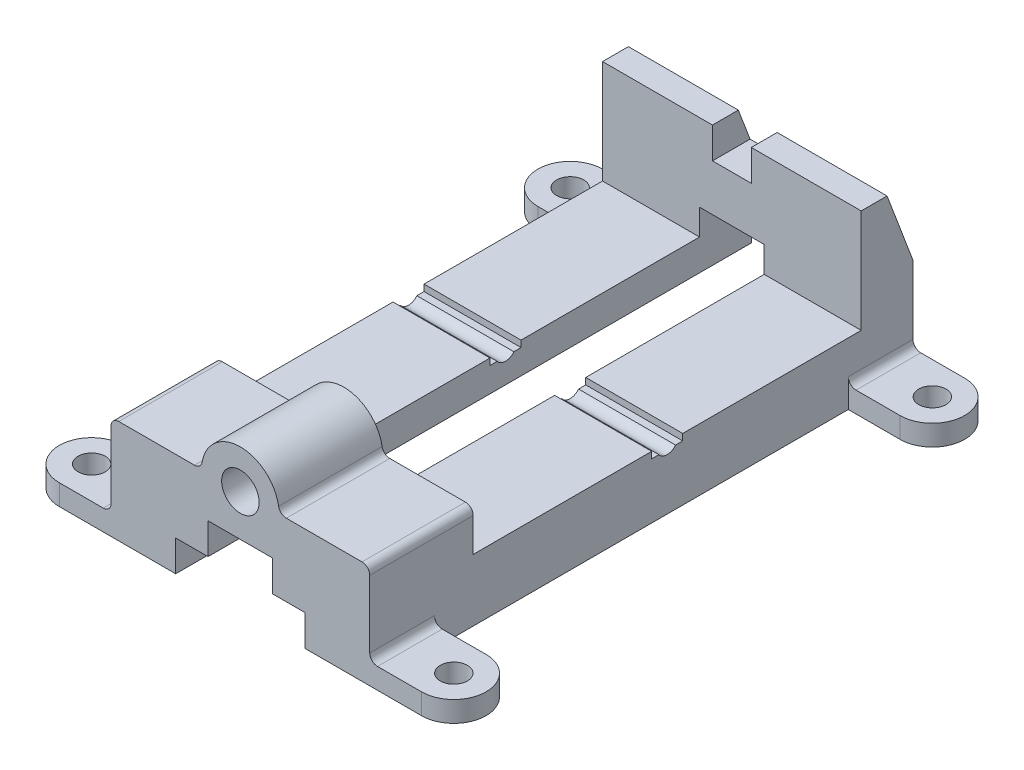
from build123d import *

# Parameters (mm, degrees)
EXTRUDE1_DEPTH             = 210
CUT_EXTRUDE1_REACH         = 241.008
SKETCH2_W                  = 150
SKETCH2_H                  = 31
SKETCH4_W                  = 100
SKETCH4_H                  = 40
EXTRUDE2_DEPTH             = 20
CUT_EXTRUDE2_REACH         = 208.63
SKETCH5_W                  = 25
SKETCH5_H                  = 10
M16X1_5_TAPPED_HOLE1_D     = 14.5
M16X1_5_TAPPED_HOLE1_DEPTH = 40
EXTRUDE3_DEPTH             = 8
M12X1_5_TAPPED_HOLE1_D     = 10.5
FILLET2_R                  = 3
CUT_EXTRUDE3_DEPTH         = 257.422015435
CUT_EXTRUDE4_DEPTH         = 257.422015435
SKETCH14_W                 = 15
SKETCH14_H                 = 20
CUT_EXTRUDE6_DEPTH         = 12


with BuildPart() as part:
    # Sketch1 → Extrude1 (new body)
    with BuildSketch(Plane.XY):
        with BuildLine():
            Line((-25, 0), (-50, 0))
            Line((-50, 0), (-50, 40))
            Line((-50, 40), (-15, 40))
            ThreePointArc((-15, 40), (0, 55), (15, 40))
            Line((15, 40), (50, 40))
            Line((50, 40), (50, 0))
            Line((50, 0), (25, 0))
            Line((25, 0), (25, 12))
            Line((25, 12), (12.5, 12))
            Line((12.5, 12), (12.5, 24))
            Line((12.5, 24), (-12.5, 24))
            Line((-12.5, 24), (-12.5, 12))
            Line((-12.5, 12), (-25, 12))
            Line((-25, 12), (-25, 0))
        make_face()
    extrude(amount=-EXTRUDE1_DEPTH)

    # Sketch2 → Cut-Extrude1 (cut, up to next)
    with BuildSketch(Plane(origin=(50, 0, 0), x_dir=(0, 0, -1), z_dir=(1, 0, 0)), mode=Mode.PRIVATE) as cut_extrude1_sk1:
        with Locations((115, 39.5)):
            Rectangle(SKETCH2_W, SKETCH2_H)
    cut_extrude1_tool1 = extrude(cut_extrude1_sk1.sketch, amount=-CUT_EXTRUDE1_REACH, mode=Mode.PRIVATE) & part.part
    add(cut_extrude1_tool1.solids().sort_by_distance((50, 39.5, -115))[0], mode=Mode.SUBTRACT)

    # Sketch4 → Extrude2 (add)
    with BuildSketch(Plane.XY.offset(-190)):
        with Locations((0, 44)):
            Rectangle(SKETCH4_W, SKETCH4_H)
    extrude(amount=-EXTRUDE2_DEPTH)

    # Sketch5 → Cut-Extrude2 (cut, up to next)
    with BuildSketch(Plane.XY.offset(-190), mode=Mode.PRIVATE) as cut_extrude2_sk1:
        with Locations((0, 29)):
            Rectangle(SKETCH5_W, SKETCH5_H)
    cut_extrude2_tool1 = extrude(cut_extrude2_sk1.sketch, amount=-CUT_EXTRUDE2_REACH, mode=Mode.PRIVATE) & part.part
    add(cut_extrude2_tool1.solids().sort_by_distance((0, 29, -190))[0], mode=Mode.SUBTRACT)

    # M16x1.5 Tapped Hole1
    with Locations(Plane.XY):
        with Locations((0, 40)):
            Hole(M16X1_5_TAPPED_HOLE1_D / 2, depth=M16X1_5_TAPPED_HOLE1_DEPTH)

    # Sketch8 → Extrude3 (add)
    with BuildSketch(Plane(origin=(0, 0, 0), x_dir=(1, 0, 0), z_dir=(0, 1, 0))):
        with BuildLine():
            Line((50, 0), (70, 0))
            ThreePointArc((70, 0), (82.5, 12.5), (70, 25))
            Line((70, 25), (50, 25))
            Line((50, 25), (50, 0))
        make_face()
        with BuildLine():
            Line((50, 185), (50, 210))
            Line((50, 210), (70, 210))
            ThreePointArc((70, 210), (82.5, 197.5), (70, 185))
            Line((70, 185), (50, 185))
        make_face()
        with BuildLine():
            Line((-50, 25), (-50, 0))
            Line((-50, 0), (-70, 0))
            ThreePointArc((-70, 0), (-82.5, 12.5), (-70, 25))
            Line((-70, 25), (-50, 25))
        make_face()
        with BuildLine():
            Line((-50, 210), (-70, 210))
            ThreePointArc((-70, 210), (-82.5, 197.5), (-70, 185))
            Line((-70, 185), (-50, 185))
            Line((-50, 185), (-50, 210))
        make_face()
    extrude(amount=EXTRUDE3_DEPTH)

    # M12x1.5 Tapped Hole1 (through all)
    with Locations(Plane(origin=(0, 8, 0), x_dir=(-1, 0, 0), z_dir=(0, 1, 0))):
        with Locations((-70, -12.5), (-70, -197.5), (70, -197.5), (70, -12.5)):
            Hole(M12X1_5_TAPPED_HOLE1_D / 2)

    # Fillet2
    fillet2_edges = [part.edges().sort_by_distance(p)[0] for p in [
        (-50, 8, -197.5),
        (-50, 8, -12.5),
        (-15, 40, -20),
        (15, 40, -20),
        (50, 8, -197.5),
        (50, 8, -12.5),
        (50, 40, -20),
        (-50, 40, -20),
    ]]
    fillet(fillet2_edges, radius=FILLET2_R)

    # Sketch11 → Cut-Extrude3 (cut, through all)
    with BuildSketch(Plane(origin=(50, 0, 0), x_dir=(0, 0, -1), z_dir=(1, 0, 0))):
        with BuildLine():
            Line((118.226112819, 21.5), (121, 21.5))
            Line((121, 21.5), (121, 24))
            Line((121, 24), (109, 24))
            Line((109, 24), (109, 21.5))
            Line((109, 21.5), (111.773887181, 21.5))
            ThreePointArc((111.773887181, 21.5), (115, 19.9186027), (118.226112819, 21.5))
        make_face()
    extrude(amount=-CUT_EXTRUDE3_DEPTH, mode=Mode.SUBTRACT)

    # Sketch12 → Cut-Extrude4 (cut, through all)
    with BuildSketch(Plane(origin=(50, 0, 0), x_dir=(0, 0, -1), z_dir=(1, 0, 0))):
        Polygon((200, 64), (210, 37.5), (210, 64), align=None)
    extrude(amount=-CUT_EXTRUDE4_DEPTH, mode=Mode.SUBTRACT)

    # Sketch14 → Cut-Extrude6 (cut)
    with BuildSketch(Plane(origin=(0, 64, 0), x_dir=(-1, 0, 0), z_dir=(0, 1, 0))):
        with Locations((0, -200)):
            Rectangle(SKETCH14_W, SKETCH14_H)
    extrude(amount=-CUT_EXTRUDE6_DEPTH, mode=Mode.SUBTRACT)


solid = part.part
